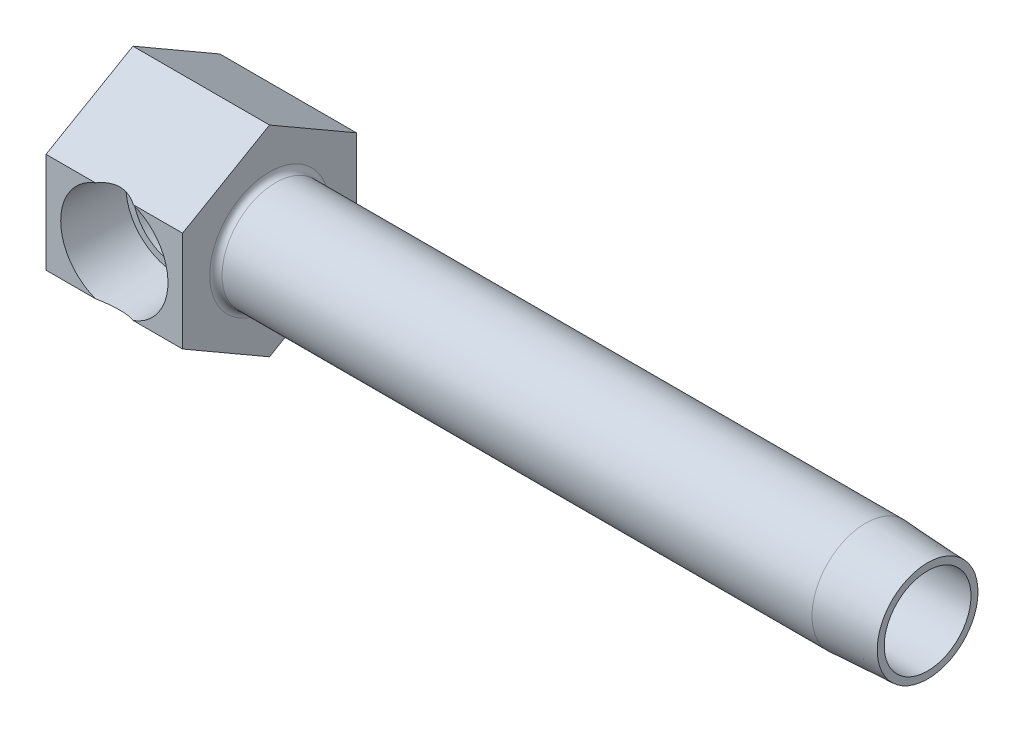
ISO-10303-21;
HEADER;
FILE_DESCRIPTION(('STEP AP214'),'2;1');
FILE_NAME('part.step','',(''),(''),'','','');
FILE_SCHEMA(('AUTOMOTIVE_DESIGN { 1 0 10303 214 1 1 1 1 }'));
ENDSEC;
DATA;
#1=APPLICATION_CONTEXT('core data for automotive mechanical design processes');
#2=APPLICATION_PROTOCOL_DEFINITION('international standard','automotive_design',2000,#1);
#3=PRODUCT_CONTEXT('',#1,'mechanical');
#4=PRODUCT('Part','Part','',(#3));
#5=PRODUCT_RELATED_PRODUCT_CATEGORY('part','',(#4));
#6=PRODUCT_DEFINITION_FORMATION('','',#4);
#7=PRODUCT_DEFINITION_CONTEXT('part definition',#1,'design');
#8=PRODUCT_DEFINITION('design','',#6,#7);
#9=PRODUCT_DEFINITION_SHAPE('','',#8);
#10=(LENGTH_UNIT() NAMED_UNIT(*) SI_UNIT(.MILLI.,.METRE.));
#11=(NAMED_UNIT(*) PLANE_ANGLE_UNIT() SI_UNIT($,.RADIAN.));
#12=(NAMED_UNIT(*) SI_UNIT($,.STERADIAN.) SOLID_ANGLE_UNIT());
#13=UNCERTAINTY_MEASURE_WITH_UNIT(LENGTH_MEASURE(1.E-05),#10,'distance_accuracy_value','');
#14=(GEOMETRIC_REPRESENTATION_CONTEXT(3) GLOBAL_UNCERTAINTY_ASSIGNED_CONTEXT((#13)) GLOBAL_UNIT_ASSIGNED_CONTEXT((#10,
#11,#12)) REPRESENTATION_CONTEXT('',''));
#15=CARTESIAN_POINT('',(0.,0.,0.));
#16=DIRECTION('',(0.,0.,1.));
#17=DIRECTION('',(1.,0.,0.));
#18=AXIS2_PLACEMENT_3D('',#15,#16,#17);
#19=CARTESIAN_POINT('',(63.5,0.,11.1125));
#20=DIRECTION('',(-1.,0.,0.));
#21=DIRECTION('',(0.,0.,1.));
#22=AXIS2_PLACEMENT_3D('',#19,#20,#21);
#23=CYLINDRICAL_SURFACE('',#22,6.858);
#24=CARTESIAN_POINT('',(18.2499,0.,11.1125));
#25=DIRECTION('',(-1.,0.,0.));
#26=DIRECTION('',(0.,-1.,0.));
#27=AXIS2_PLACEMENT_3D('',#24,#25,#26);
#28=CIRCLE('',#27,6.858);
#29=CARTESIAN_POINT('',(18.2499,-6.858,11.1125));
#30=VERTEX_POINT('',#29);
#31=EDGE_CURVE('E22',#30,#30,#28,.F.);
#32=ORIENTED_EDGE('',*,*,#31,.T.);
#33=EDGE_LOOP('',(#32));
#34=FACE_BOUND('',#33,.T.);
#35=CARTESIAN_POINT('',(93.6752,0.,11.1125));
#36=DIRECTION('',(1.,0.,0.));
#37=DIRECTION('',(0.,0.,-1.));
#38=AXIS2_PLACEMENT_3D('',#35,#36,#37);
#39=CIRCLE('',#38,6.858);
#40=CARTESIAN_POINT('',(93.6752,0.,4.2545));
#41=VERTEX_POINT('',#40);
#42=EDGE_CURVE('E156',#41,#41,#39,.T.);
#43=ORIENTED_EDGE('',*,*,#42,.F.);
#44=EDGE_LOOP('',(#43));
#45=FACE_BOUND('',#44,.T.);
#46=ADVANCED_FACE('F15',(#34,#45),#23,.T.);
#47=CARTESIAN_POINT('',(8.7376,0.,22.225));
#48=DIRECTION('',(0.,0.,1.));
#49=DIRECTION('',(1.,0.,0.));
#50=AXIS2_PLACEMENT_3D('',#47,#48,#49);
#51=CONICAL_SURFACE('',#50,6.858,0.0523598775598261);
#52=CARTESIAN_POINT('',(8.7376,-0.680996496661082,34.5170205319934));
#53=DIRECTION('',(0.,-0.866025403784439,-0.5));
#54=DIRECTION('',(0.,-0.5,0.866025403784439));
#55=AXIS2_PLACEMENT_3D('',#52,#53,#54);
#56=ELLIPSE('',#55,15.0043949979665,7.47122554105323);
#57=CARTESIAN_POINT('',(11.1603281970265,6.4158048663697,22.225));
#58=VERTEX_POINT('',#57);
#59=CARTESIAN_POINT('',(6.3148718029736,6.4158048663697,22.225));
#60=VERTEX_POINT('',#59);
#61=EDGE_CURVE('E232',#58,#60,#56,.F.);
#62=ORIENTED_EDGE('',*,*,#61,.T.);
#63=CARTESIAN_POINT('',(8.7376,0.,22.225));
#64=DIRECTION('',(0.,0.,-1.));
#65=DIRECTION('',(-1.,0.,0.));
#66=AXIS2_PLACEMENT_3D('',#63,#64,#65);
#67=CIRCLE('',#66,6.858);
#68=CARTESIAN_POINT('',(6.31487180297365,-6.41580486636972,22.225));
#69=VERTEX_POINT('',#68);
#70=EDGE_CURVE('E36',#69,#60,#67,.T.);
#71=ORIENTED_EDGE('',*,*,#70,.F.);
#72=CARTESIAN_POINT('',(8.7376,0.680996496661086,34.5170205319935));
#73=DIRECTION('',(0.,0.866025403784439,-0.5));
#74=DIRECTION('',(0.,0.5,0.866025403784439));
#75=AXIS2_PLACEMENT_3D('',#72,#73,#74);
#76=ELLIPSE('',#75,15.0043949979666,7.47122554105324);
#77=CARTESIAN_POINT('',(11.1603281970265,-6.4158048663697,22.225));
#78=VERTEX_POINT('',#77);
#79=EDGE_CURVE('E10',#69,#78,#76,.F.);
#80=ORIENTED_EDGE('',*,*,#79,.T.);
#81=EDGE_CURVE('E249',#58,#78,#67,.T.);
#82=ORIENTED_EDGE('',*,*,#81,.F.);
#83=EDGE_LOOP('',(#62,#71,#80,#82));
#84=FACE_BOUND('',#83,.T.);
#85=CARTESIAN_POINT('',(8.7376,0.,14.3002));
#86=DIRECTION('',(0.,0.,-1.));
#87=DIRECTION('',(-1.,0.,0.));
#88=AXIS2_PLACEMENT_3D('',#85,#86,#87);
#89=CIRCLE('',#88,6.44267883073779);
#90=CARTESIAN_POINT('',(13.3057672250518,-4.54312213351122,14.3002));
#91=VERTEX_POINT('',#90);
#92=CARTESIAN_POINT('',(13.3057672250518,4.54312213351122,14.3002));
#93=VERTEX_POINT('',#92);
#94=EDGE_CURVE('E251',#91,#93,#89,.T.);
#95=ORIENTED_EDGE('',*,*,#94,.T.);
#96=CARTESIAN_POINT('',(13.3056128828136,4.54326245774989,14.3));
#97=CARTESIAN_POINT('',(13.4050037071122,4.45290836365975,14.4287190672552));
#98=CARTESIAN_POINT('',(13.5038252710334,4.35690222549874,14.5539811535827));
#99=CARTESIAN_POINT('',(13.6989301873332,4.15324987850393,14.7972290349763));
#100=CARTESIAN_POINT('',(13.7952093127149,4.04558563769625,14.9152031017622));
#101=CARTESIAN_POINT('',(13.9843700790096,3.81752411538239,15.1441485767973));
#102=CARTESIAN_POINT('',(14.0772125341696,3.69701926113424,15.25504596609));
#103=CARTESIAN_POINT('',(14.2568464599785,3.44414434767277,15.4675620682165));
#104=CARTESIAN_POINT('',(14.3436418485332,3.31178210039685,15.5691868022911));
#105=CARTESIAN_POINT('',(14.5527686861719,2.962976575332,15.8122617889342));
#106=CARTESIAN_POINT('',(14.6701286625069,2.73858307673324,15.9469651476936));
#107=CARTESIAN_POINT('',(14.8276174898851,2.38307262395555,16.1264780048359));
#108=CARTESIAN_POINT('',(14.8769849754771,2.2615363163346,16.1825173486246));
#109=CARTESIAN_POINT('',(14.9687772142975,2.0125151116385,16.2864098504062));
#110=CARTESIAN_POINT('',(15.0112056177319,1.88503338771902,16.3342673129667));
#111=CARTESIAN_POINT('',(15.088733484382,1.6232487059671,16.4215218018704));
#112=CARTESIAN_POINT('',(15.1237419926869,1.48888366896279,16.4608139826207));
#113=CARTESIAN_POINT('',(15.1849785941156,1.21573970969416,16.5294343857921));
#114=CARTESIAN_POINT('',(15.2112114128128,1.0769632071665,16.5587679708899));
#115=CARTESIAN_POINT('',(15.2542466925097,0.796159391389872,16.6068431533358));
#116=CARTESIAN_POINT('',(15.2710505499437,0.654132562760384,16.6255863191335));
#117=CARTESIAN_POINT('',(15.2947665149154,0.368243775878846,16.6520290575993));
#118=CARTESIAN_POINT('',(15.3016803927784,0.22438215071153,16.6597306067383));
#119=CARTESIAN_POINT('',(15.3051381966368,-0.0413792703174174,16.6635827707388));
#120=CARTESIAN_POINT('',(15.3031178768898,-0.163241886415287,16.6613326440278));
#121=CARTESIAN_POINT('',(15.2919140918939,-0.406265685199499,16.6488476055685));
#122=CARTESIAN_POINT('',(15.282728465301,-0.527426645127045,16.6386102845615));
#123=CARTESIAN_POINT('',(15.2573805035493,-0.768029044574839,16.6103343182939));
#124=CARTESIAN_POINT('',(15.2412218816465,-0.88747136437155,16.5922998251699));
#125=CARTESIAN_POINT('',(15.2022471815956,-1.1238947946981,16.5487418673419));
#126=CARTESIAN_POINT('',(15.1794285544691,-1.24087494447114,16.5232155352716));
#127=CARTESIAN_POINT('',(15.1030013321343,-1.58064044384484,16.4375716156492));
#128=CARTESIAN_POINT('',(15.0406598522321,-1.79907617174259,16.3675454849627));
#129=CARTESIAN_POINT('',(14.8959772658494,-2.2198653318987,16.2041288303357));
#130=CARTESIAN_POINT('',(14.8136249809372,-2.42220969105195,16.1107252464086));
#131=CARTESIAN_POINT('',(14.6581620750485,-2.75475802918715,15.9330467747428));
#132=CARTESIAN_POINT('',(14.588877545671,-2.88934500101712,15.8534887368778));
#133=CARTESIAN_POINT('',(14.4433958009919,-3.14876465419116,15.6853070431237));
#134=CARTESIAN_POINT('',(14.3671982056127,-3.27359679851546,15.5966828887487));
#135=CARTESIAN_POINT('',(14.2091096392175,-3.51355050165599,15.4112660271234));
#136=CARTESIAN_POINT('',(14.1272094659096,-3.62865566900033,15.3144600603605));
#137=CARTESIAN_POINT('',(13.9591121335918,-3.84892561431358,15.1136697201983));
#138=CARTESIAN_POINT('',(13.8729164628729,-3.95409379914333,15.0096878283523));
#139=CARTESIAN_POINT('',(13.7069469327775,-4.14374167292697,14.806812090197));
#140=CARTESIAN_POINT('',(13.62749258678,-4.22922772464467,14.7085925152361));
#141=CARTESIAN_POINT('',(13.4673498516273,-4.39212627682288,14.5076746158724));
#142=CARTESIAN_POINT('',(13.386669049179,-4.46957495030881,14.404999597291));
#143=CARTESIAN_POINT('',(13.3056128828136,-4.54326245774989,14.3));
#144=B_SPLINE_CURVE_WITH_KNOTS('',3,(#96,#97,#98,#99,#100,#101,#102,#103,#104,#105,#106,#107,
#108,#109,#110,#111,#112,#113,#114,#115,#116,#117,#118,#119,#120,#121,#122,#123,#124,#125,#126,
#127,#128,#129,#130,#131,#132,#133,#134,#135,#136,#137,#138,#139,#140,#141,#142,#143),
.UNSPECIFIED.,.F.,.F.,(4,2,2,2,2,2,2,2,2,2,2,2,2,2,2,2,2,2,2,2,2,2,2,4),(0.,0.55807217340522,
1.11702021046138,1.68108674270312,2.24478434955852,3.10140634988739,3.52893103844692,
3.95623010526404,4.38849766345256,4.82053207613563,5.25250248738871,5.68439556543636,
6.04963287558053,6.41498039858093,6.78013360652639,7.14542675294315,7.85550743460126,
8.56598569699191,9.07835413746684,9.59075076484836,10.1039943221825,10.6170612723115,
11.0743952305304,11.5295724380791),.UNSPECIFIED.);
#145=EDGE_CURVE('E130',#93,#91,#144,.T.);
#146=ORIENTED_EDGE('',*,*,#145,.T.);
#147=EDGE_LOOP('',(#95,#146));
#148=FACE_BOUND('',#147,.T.);
#149=ADVANCED_FACE('F138',(#84,#148),#51,.F.);
#150=CARTESIAN_POINT('',(15.1802788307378,0.,14.3002));
#151=DIRECTION('',(0.,0.,1.));
#152=DIRECTION('',(1.,0.,0.));
#153=AXIS2_PLACEMENT_3D('',#150,#151,#152);
#154=PLANE('',#153);
#155=ORIENTED_EDGE('',*,*,#94,.F.);
#156=DIRECTION('',(1.,0.,0.));
#157=VECTOR('',#156,1.);
#158=CARTESIAN_POINT('',(65.6255637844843,-4.54312213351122,14.3002));
#159=LINE('',#158,#157);
#160=CARTESIAN_POINT('',(11.9253,-4.54312213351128,14.3002));
#161=VERTEX_POINT('',#160);
#162=EDGE_CURVE('E128',#91,#161,#159,.F.);
#163=ORIENTED_EDGE('',*,*,#162,.T.);
#164=CARTESIAN_POINT('',(8.7376,0.,14.3002));
#165=DIRECTION('',(0.,0.,-1.));
#166=DIRECTION('',(-1.,0.,0.));
#167=AXIS2_PLACEMENT_3D('',#164,#165,#166);
#168=CIRCLE('',#167,5.5499);
#169=CARTESIAN_POINT('',(11.9253,4.54312213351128,14.3002));
#170=VERTEX_POINT('',#169);
#171=EDGE_CURVE('E120',#161,#170,#168,.T.);
#172=ORIENTED_EDGE('',*,*,#171,.T.);
#173=DIRECTION('',(1.,0.,0.));
#174=VECTOR('',#173,1.);
#175=CARTESIAN_POINT('',(65.6255637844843,4.54312213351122,14.3002));
#176=LINE('',#175,#174);
#177=EDGE_CURVE('E123',#170,#93,#176,.T.);
#178=ORIENTED_EDGE('',*,*,#177,.T.);
#179=EDGE_LOOP('',(#155,#163,#172,#178));
#180=FACE_BOUND('',#179,.T.);
#181=ADVANCED_FACE('F181',(#180),#154,.T.);
#182=CARTESIAN_POINT('',(8.7376,0.,27.6280516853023));
#183=DIRECTION('',(0.,0.,-1.));
#184=DIRECTION('',(-1.,0.,0.));
#185=AXIS2_PLACEMENT_3D('',#182,#183,#184);
#186=CYLINDRICAL_SURFACE('',#185,5.5499);
#187=ORIENTED_EDGE('',*,*,#171,.F.);
#188=CARTESIAN_POINT('',(8.7376,0.,11.1125));
#189=DIRECTION('',(0.707106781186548,0.,-0.707106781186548));
#190=DIRECTION('',(-0.707106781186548,0.,-0.707106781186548));
#191=AXIS2_PLACEMENT_3D('',#188,#189,#190);
#192=ELLIPSE('',#191,7.84874384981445,5.5499);
#193=CARTESIAN_POINT('',(8.7376,-5.5499,11.1125));
#194=VERTEX_POINT('',#193);
#195=EDGE_CURVE('E109',#161,#194,#192,.T.);
#196=ORIENTED_EDGE('',*,*,#195,.T.);
#197=CARTESIAN_POINT('',(8.7376,0.,11.1125));
#198=DIRECTION('',(-0.707106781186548,0.,-0.707106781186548));
#199=DIRECTION('',(0.707106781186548,0.,-0.707106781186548));
#200=AXIS2_PLACEMENT_3D('',#197,#198,#199);
#201=ELLIPSE('',#200,7.84874384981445,5.5499);
#202=CARTESIAN_POINT('',(13.4708637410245,-2.89786203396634,6.37923625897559));
#203=VERTEX_POINT('',#202);
#204=EDGE_CURVE('E104',#194,#203,#201,.F.);
#205=ORIENTED_EDGE('',*,*,#204,.T.);
#206=CARTESIAN_POINT('',(8.7376,0.,6.37923625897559));
#207=DIRECTION('',(0.,0.,-1.));
#208=DIRECTION('',(-1.,0.,0.));
#209=AXIS2_PLACEMENT_3D('',#206,#207,#208);
#210=CIRCLE('',#209,5.5499);
#211=CARTESIAN_POINT('',(13.4708637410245,2.89786203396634,6.37923625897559));
#212=VERTEX_POINT('',#211);
#213=EDGE_CURVE('E136',#203,#212,#210,.T.);
#214=ORIENTED_EDGE('',*,*,#213,.T.);
#215=CARTESIAN_POINT('',(8.7376,5.5499,11.1125));
#216=VERTEX_POINT('',#215);
#217=EDGE_CURVE('E29',#212,#216,#201,.F.);
#218=ORIENTED_EDGE('',*,*,#217,.T.);
#219=EDGE_CURVE('E121',#216,#170,#192,.T.);
#220=ORIENTED_EDGE('',*,*,#219,.T.);
#221=EDGE_LOOP('',(#187,#196,#205,#214,#218,#220));
#222=FACE_BOUND('',#221,.T.);
#223=ADVANCED_FACE('F117',(#222),#186,.F.);
#224=CARTESIAN_POINT('',(8.7376,0.,6.37923625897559));
#225=DIRECTION('',(0.,0.,1.));
#226=DIRECTION('',(1.,0.,0.));
#227=AXIS2_PLACEMENT_3D('',#224,#225,#226);
#228=CONICAL_SURFACE('',#227,5.5499,1.04719755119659);
#229=CARTESIAN_POINT('',(8.7376,0.,3.175));
#230=VERTEX_POINT('',#229);
#231=VERTEX_LOOP('',#230);
#232=FACE_BOUND('',#231,.T.);
#233=ORIENTED_EDGE('',*,*,#213,.F.);
#234=CARTESIAN_POINT('',(13.4710699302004,-2.89818868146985,6.37943625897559));
#235=CARTESIAN_POINT('',(13.420685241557,-2.8185279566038,6.33063423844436));
#236=CARTESIAN_POINT('',(13.3737513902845,-2.73601453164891,6.2828976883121));
#237=CARTESIAN_POINT('',(13.2869939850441,-2.56583570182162,6.19038737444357));
#238=CARTESIAN_POINT('',(13.2471660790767,-2.47817349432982,6.14561180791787));
#239=CARTESIAN_POINT('',(13.1751547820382,-2.29911606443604,6.06025322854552));
#240=CARTESIAN_POINT('',(13.1428940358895,-2.20777091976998,6.01963042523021));
#241=CARTESIAN_POINT('',(13.0851463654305,-2.02119544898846,5.94274790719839));
#242=CARTESIAN_POINT('',(13.0596596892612,-1.92596498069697,5.90648835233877));
#243=CARTESIAN_POINT('',(13.0148514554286,-1.73255643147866,5.83897057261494));
#244=CARTESIAN_POINT('',(12.9955185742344,-1.63438413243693,5.80770321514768));
#245=CARTESIAN_POINT('',(12.9620830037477,-1.4356334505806,5.75050007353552));
#246=CARTESIAN_POINT('',(12.9479806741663,-1.33505490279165,5.72456465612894));
#247=CARTESIAN_POINT('',(12.9240526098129,-1.13183172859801,5.67823452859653));
#248=CARTESIAN_POINT('',(12.9142392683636,-1.0291819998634,5.65785593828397));
#249=CARTESIAN_POINT('',(12.8981074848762,-0.822623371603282,5.62290462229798));
#250=CARTESIAN_POINT('',(12.891789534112,-0.718714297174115,5.60833271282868));
#251=CARTESIAN_POINT('',(12.8810293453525,-0.489671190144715,5.58281999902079));
#252=CARTESIAN_POINT('',(12.8771967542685,-0.364365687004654,5.57314917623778));
#253=CARTESIAN_POINT('',(12.8729275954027,-0.113319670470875,5.56233429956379));
#254=CARTESIAN_POINT('',(12.8724915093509,0.0124209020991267,5.56119145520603));
#255=CARTESIAN_POINT('',(12.874939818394,0.263686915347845,5.567443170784));
#256=CARTESIAN_POINT('',(12.8778249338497,0.389212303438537,5.57483958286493));
#257=CARTESIAN_POINT('',(12.8874191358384,0.639322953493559,5.59811647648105));
#258=CARTESIAN_POINT('',(12.8941278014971,0.763908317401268,5.61399602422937));
#259=CARTESIAN_POINT('',(12.9116197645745,1.00072761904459,5.65236645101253));
#260=CARTESIAN_POINT('',(12.9220027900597,1.11310193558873,5.6741708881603));
#261=CARTESIAN_POINT('',(12.9479188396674,1.33574469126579,5.72453194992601));
#262=CARTESIAN_POINT('',(12.9634519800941,1.44601308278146,5.75308872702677));
#263=CARTESIAN_POINT('',(13.00082798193,1.66326683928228,5.81649299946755));
#264=CARTESIAN_POINT('',(13.022650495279,1.77026157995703,5.85132007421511));
#265=CARTESIAN_POINT('',(13.0737132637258,1.98033019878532,5.92673676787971));
#266=CARTESIAN_POINT('',(13.1029503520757,2.08340572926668,5.96732392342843));
#267=CARTESIAN_POINT('',(13.1785970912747,2.31167706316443,6.06504898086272));
#268=CARTESIAN_POINT('',(13.2275080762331,2.43541928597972,6.12371071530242));
#269=CARTESIAN_POINT('',(13.3111431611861,2.61414296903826,6.21635789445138));
#270=CARTESIAN_POINT('',(13.3408272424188,2.67271819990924,6.24810824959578));
#271=CARTESIAN_POINT('',(13.4034989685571,2.78735967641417,6.31288069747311));
#272=CARTESIAN_POINT('',(13.4364871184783,2.8434255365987,6.34590298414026));
#273=CARTESIAN_POINT('',(13.4710699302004,2.89818868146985,6.37943625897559));
#274=B_SPLINE_CURVE_WITH_KNOTS('',3,(#234,#235,#236,#237,#238,#239,#240,#241,#242,#243,#244,
#245,#246,#247,#248,#249,#250,#251,#252,#253,#254,#255,#256,#257,#258,#259,#260,#261,#262,#263,
#264,#265,#266,#267,#268,#269,#270,#271,#272,#273),.UNSPECIFIED.,.F.,.F.,(4,2,2,2,2,2,2,2,2,2,2,
2,2,2,2,2,2,2,2,4),(0.,0.318348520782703,0.636501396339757,0.951244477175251,1.26599908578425,
1.58017112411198,1.89436476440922,2.20946038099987,2.52460027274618,2.90145665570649,
3.27836648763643,3.65535808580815,4.03230819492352,4.37682355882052,4.72134670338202,
5.06476748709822,5.40804184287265,5.84309066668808,6.06180090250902,6.28054461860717),.UNSPECIFIED.);
#275=EDGE_CURVE('E111',#203,#212,#274,.T.);
#276=ORIENTED_EDGE('',*,*,#275,.T.);
#277=EDGE_LOOP('',(#233,#276));
#278=FACE_BOUND('',#277,.T.);
#279=ADVANCED_FACE('F148',(#232,#278),#228,.F.);
#280=CARTESIAN_POINT('',(17.4625,12.8316097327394,11.1125));
#281=DIRECTION('',(0.,-0.866025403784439,-0.5));
#282=DIRECTION('',(0.,0.5,-0.866025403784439));
#283=AXIS2_PLACEMENT_3D('',#280,#281,#282);
#284=PLANE('',#283);
#285=ORIENTED_EDGE('',*,*,#61,.F.);
#286=DIRECTION('',(-1.,0.,0.));
#287=VECTOR('',#286,1.);
#288=CARTESIAN_POINT('',(17.4625,6.4158048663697,22.225));
#289=LINE('',#288,#287);
#290=CARTESIAN_POINT('',(17.4625,6.4158048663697,22.225));
#291=VERTEX_POINT('',#290);
#292=EDGE_CURVE('E202',#291,#58,#289,.T.);
#293=ORIENTED_EDGE('',*,*,#292,.F.);
#294=DIRECTION('',(0.,-0.5,0.866025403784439));
#295=VECTOR('',#294,1.);
#296=CARTESIAN_POINT('',(17.4625,12.8316097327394,11.1125));
#297=LINE('',#296,#295);
#298=CARTESIAN_POINT('',(17.4625,12.8316097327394,11.1125));
#299=VERTEX_POINT('',#298);
#300=EDGE_CURVE('E222',#299,#291,#297,.T.);
#301=ORIENTED_EDGE('',*,*,#300,.F.);
#302=DIRECTION('',(-1.,0.,0.));
#303=VECTOR('',#302,1.);
#304=CARTESIAN_POINT('',(17.4625,12.8316097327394,11.1125));
#305=LINE('',#304,#303);
#306=CARTESIAN_POINT('',(0.,12.8316097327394,11.1125));
#307=VERTEX_POINT('',#306);
#308=EDGE_CURVE('E199',#299,#307,#305,.T.);
#309=ORIENTED_EDGE('',*,*,#308,.T.);
#310=DIRECTION('',(0.,-0.5,0.866025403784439));
#311=VECTOR('',#310,1.);
#312=CARTESIAN_POINT('',(0.,12.8316097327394,11.1125));
#313=LINE('',#312,#311);
#314=CARTESIAN_POINT('',(0.,6.4158048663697,22.225));
#315=VERTEX_POINT('',#314);
#316=EDGE_CURVE('E239',#307,#315,#313,.T.);
#317=ORIENTED_EDGE('',*,*,#316,.T.);
#318=EDGE_CURVE('E205',#60,#315,#289,.T.);
#319=ORIENTED_EDGE('',*,*,#318,.F.);
#320=EDGE_LOOP('',(#285,#293,#301,#309,#317,#319));
#321=FACE_BOUND('',#320,.T.);
#322=ADVANCED_FACE('F256',(#321),#284,.F.);
#323=CARTESIAN_POINT('',(17.4625,6.4158048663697,22.225));
#324=DIRECTION('',(0.,0.,-1.));
#325=DIRECTION('',(0.,1.,0.));
#326=AXIS2_PLACEMENT_3D('',#323,#324,#325);
#327=PLANE('',#326);
#328=ORIENTED_EDGE('',*,*,#70,.T.);
#329=ORIENTED_EDGE('',*,*,#318,.T.);
#330=DIRECTION('',(0.,-1.,0.));
#331=VECTOR('',#330,1.);
#332=CARTESIAN_POINT('',(0.,6.4158048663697,22.225));
#333=LINE('',#332,#331);
#334=CARTESIAN_POINT('',(0.,-6.41580486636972,22.225));
#335=VERTEX_POINT('',#334);
#336=EDGE_CURVE('E235',#315,#335,#333,.T.);
#337=ORIENTED_EDGE('',*,*,#336,.T.);
#338=DIRECTION('',(-1.,0.,0.));
#339=VECTOR('',#338,1.);
#340=CARTESIAN_POINT('',(17.4625,-6.41580486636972,22.225));
#341=LINE('',#340,#339);
#342=EDGE_CURVE('E209',#69,#335,#341,.T.);
#343=ORIENTED_EDGE('',*,*,#342,.F.);
#344=EDGE_LOOP('',(#328,#329,#337,#343));
#345=FACE_BOUND('',#344,.T.);
#346=ADVANCED_FACE('F263',(#345),#327,.F.);
#347=ORIENTED_EDGE('',*,*,#81,.T.);
#348=CARTESIAN_POINT('',(17.4625,-6.41580486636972,22.225));
#349=VERTEX_POINT('',#348);
#350=EDGE_CURVE('E206',#349,#78,#341,.T.);
#351=ORIENTED_EDGE('',*,*,#350,.F.);
#352=DIRECTION('',(0.,-1.,0.));
#353=VECTOR('',#352,1.);
#354=CARTESIAN_POINT('',(17.4625,6.4158048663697,22.225));
#355=LINE('',#354,#353);
#356=EDGE_CURVE('E220',#291,#349,#355,.T.);
#357=ORIENTED_EDGE('',*,*,#356,.F.);
#358=ORIENTED_EDGE('',*,*,#292,.T.);
#359=EDGE_LOOP('',(#347,#351,#357,#358));
#360=FACE_BOUND('',#359,.T.);
#361=ADVANCED_FACE('F287',(#360),#327,.F.);
#362=CARTESIAN_POINT('',(17.4625,-6.41580486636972,22.225));
#363=DIRECTION('',(0.,0.866025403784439,-0.5));
#364=DIRECTION('',(0.,0.5,0.866025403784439));
#365=AXIS2_PLACEMENT_3D('',#362,#363,#364);
#366=PLANE('',#365);
#367=ORIENTED_EDGE('',*,*,#79,.F.);
#368=ORIENTED_EDGE('',*,*,#342,.T.);
#369=DIRECTION('',(0.,-0.5,-0.866025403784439));
#370=VECTOR('',#369,1.);
#371=CARTESIAN_POINT('',(0.,-6.41580486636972,22.225));
#372=LINE('',#371,#370);
#373=CARTESIAN_POINT('',(0.,-12.8316097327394,11.1125));
#374=VERTEX_POINT('',#373);
#375=EDGE_CURVE('E218',#335,#374,#372,.T.);
#376=ORIENTED_EDGE('',*,*,#375,.T.);
#377=DIRECTION('',(-1.,0.,0.));
#378=VECTOR('',#377,1.);
#379=CARTESIAN_POINT('',(17.4625,-12.8316097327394,11.1125));
#380=LINE('',#379,#378);
#381=CARTESIAN_POINT('',(17.4625,-12.8316097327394,11.1125));
#382=VERTEX_POINT('',#381);
#383=EDGE_CURVE('E210',#382,#374,#380,.T.);
#384=ORIENTED_EDGE('',*,*,#383,.F.);
#385=DIRECTION('',(0.,-0.5,-0.866025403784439));
#386=VECTOR('',#385,1.);
#387=CARTESIAN_POINT('',(17.4625,-6.41580486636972,22.225));
#388=LINE('',#387,#386);
#389=EDGE_CURVE('E213',#349,#382,#388,.T.);
#390=ORIENTED_EDGE('',*,*,#389,.F.);
#391=ORIENTED_EDGE('',*,*,#350,.T.);
#392=EDGE_LOOP('',(#367,#368,#376,#384,#390,#391));
#393=FACE_BOUND('',#392,.T.);
#394=ADVANCED_FACE('F283',(#393),#366,.F.);
#395=CARTESIAN_POINT('',(17.4625,-12.8316097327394,11.1125));
#396=DIRECTION('',(0.,0.866025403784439,0.5));
#397=DIRECTION('',(0.,-0.5,0.866025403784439));
#398=AXIS2_PLACEMENT_3D('',#395,#396,#397);
#399=PLANE('',#398);
#400=DIRECTION('',(0.,0.5,-0.866025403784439));
#401=VECTOR('',#400,1.);
#402=CARTESIAN_POINT('',(0.,-12.8316097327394,11.1125));
#403=LINE('',#402,#401);
#404=CARTESIAN_POINT('',(0.,-6.41580486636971,0.));
#405=VERTEX_POINT('',#404);
#406=EDGE_CURVE('E227',#374,#405,#403,.T.);
#407=ORIENTED_EDGE('',*,*,#406,.T.);
#408=DIRECTION('',(-1.,0.,0.));
#409=VECTOR('',#408,1.);
#410=CARTESIAN_POINT('',(17.4625,-6.41580486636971,0.));
#411=LINE('',#410,#409);
#412=CARTESIAN_POINT('',(17.4625,-6.41580486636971,0.));
#413=VERTEX_POINT('',#412);
#414=EDGE_CURVE('E191',#413,#405,#411,.T.);
#415=ORIENTED_EDGE('',*,*,#414,.F.);
#416=DIRECTION('',(0.,0.5,-0.866025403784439));
#417=VECTOR('',#416,1.);
#418=CARTESIAN_POINT('',(17.4625,-12.8316097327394,11.1125));
#419=LINE('',#418,#417);
#420=EDGE_CURVE('E214',#382,#413,#419,.T.);
#421=ORIENTED_EDGE('',*,*,#420,.F.);
#422=ORIENTED_EDGE('',*,*,#383,.T.);
#423=EDGE_LOOP('',(#407,#415,#421,#422));
#424=FACE_BOUND('',#423,.T.);
#425=ADVANCED_FACE('F286',(#424),#399,.F.);
#426=CARTESIAN_POINT('',(17.4625,-6.41580486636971,0.));
#427=DIRECTION('',(0.,0.,1.));
#428=DIRECTION('',(1.,0.,0.));
#429=AXIS2_PLACEMENT_3D('',#426,#427,#428);
#430=PLANE('',#429);
#431=DIRECTION('',(0.,1.,0.));
#432=VECTOR('',#431,1.);
#433=CARTESIAN_POINT('',(0.,-6.41580486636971,0.));
#434=LINE('',#433,#432);
#435=CARTESIAN_POINT('',(0.,6.41580486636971,0.));
#436=VERTEX_POINT('',#435);
#437=EDGE_CURVE('E231',#405,#436,#434,.T.);
#438=ORIENTED_EDGE('',*,*,#437,.T.);
#439=DIRECTION('',(-1.,0.,0.));
#440=VECTOR('',#439,1.);
#441=CARTESIAN_POINT('',(17.4625,6.41580486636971,0.));
#442=LINE('',#441,#440);
#443=CARTESIAN_POINT('',(17.4625,6.41580486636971,0.));
#444=VERTEX_POINT('',#443);
#445=EDGE_CURVE('E196',#444,#436,#442,.T.);
#446=ORIENTED_EDGE('',*,*,#445,.F.);
#447=DIRECTION('',(0.,1.,0.));
#448=VECTOR('',#447,1.);
#449=CARTESIAN_POINT('',(17.4625,-6.41580486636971,0.));
#450=LINE('',#449,#448);
#451=EDGE_CURVE('E217',#413,#444,#450,.T.);
#452=ORIENTED_EDGE('',*,*,#451,.F.);
#453=ORIENTED_EDGE('',*,*,#414,.T.);
#454=EDGE_LOOP('',(#438,#446,#452,#453));
#455=FACE_BOUND('',#454,.T.);
#456=ADVANCED_FACE('F294',(#455),#430,.F.);
#457=CARTESIAN_POINT('',(17.4625,6.4158048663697,0.));
#458=DIRECTION('',(0.,-0.866025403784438,0.5));
#459=DIRECTION('',(0.,-0.5,-0.866025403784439));
#460=AXIS2_PLACEMENT_3D('',#457,#458,#459);
#461=PLANE('',#460);
#462=DIRECTION('',(0.,0.5,0.866025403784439));
#463=VECTOR('',#462,1.);
#464=CARTESIAN_POINT('',(0.,6.4158048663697,0.));
#465=LINE('',#464,#463);
#466=EDGE_CURVE('E243',#436,#307,#465,.T.);
#467=ORIENTED_EDGE('',*,*,#466,.T.);
#468=ORIENTED_EDGE('',*,*,#308,.F.);
#469=DIRECTION('',(0.,0.5,0.866025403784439));
#470=VECTOR('',#469,1.);
#471=CARTESIAN_POINT('',(17.4625,6.4158048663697,0.));
#472=LINE('',#471,#470);
#473=EDGE_CURVE('E224',#444,#299,#472,.T.);
#474=ORIENTED_EDGE('',*,*,#473,.F.);
#475=ORIENTED_EDGE('',*,*,#445,.T.);
#476=EDGE_LOOP('',(#467,#468,#474,#475));
#477=FACE_BOUND('',#476,.T.);
#478=ADVANCED_FACE('F281',(#477),#461,.F.);
#479=CARTESIAN_POINT('',(17.4625,-19.2474145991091,22.225));
#480=DIRECTION('',(-1.,0.,0.));
#481=DIRECTION('',(0.,-1.,0.));
#482=AXIS2_PLACEMENT_3D('',#479,#480,#481);
#483=PLANE('',#482);
#484=CARTESIAN_POINT('',(17.4625,0.,11.1125));
#485=DIRECTION('',(-1.,0.,0.));
#486=DIRECTION('',(0.,-1.,0.));
#487=AXIS2_PLACEMENT_3D('',#484,#485,#486);
#488=CIRCLE('',#487,7.6454);
#489=CARTESIAN_POINT('',(17.4625,-7.6454,11.1125));
#490=VERTEX_POINT('',#489);
#491=EDGE_CURVE('E189',#490,#490,#488,.T.);
#492=ORIENTED_EDGE('',*,*,#491,.T.);
#493=EDGE_LOOP('',(#492));
#494=FACE_BOUND('',#493,.T.);
#495=ORIENTED_EDGE('',*,*,#420,.T.);
#496=ORIENTED_EDGE('',*,*,#451,.T.);
#497=ORIENTED_EDGE('',*,*,#473,.T.);
#498=ORIENTED_EDGE('',*,*,#300,.T.);
#499=ORIENTED_EDGE('',*,*,#356,.T.);
#500=ORIENTED_EDGE('',*,*,#389,.T.);
#501=EDGE_LOOP('',(#495,#496,#497,#498,#499,#500));
#502=FACE_BOUND('',#501,.T.);
#503=ADVANCED_FACE('F277',(#494,#502),#483,.F.);
#504=CARTESIAN_POINT('',(0.,-19.2474145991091,22.225));
#505=DIRECTION('',(-1.,0.,0.));
#506=DIRECTION('',(0.,-1.,0.));
#507=AXIS2_PLACEMENT_3D('',#504,#505,#506);
#508=PLANE('',#507);
#509=ORIENTED_EDGE('',*,*,#406,.F.);
#510=ORIENTED_EDGE('',*,*,#375,.F.);
#511=ORIENTED_EDGE('',*,*,#336,.F.);
#512=ORIENTED_EDGE('',*,*,#316,.F.);
#513=ORIENTED_EDGE('',*,*,#466,.F.);
#514=ORIENTED_EDGE('',*,*,#437,.F.);
#515=EDGE_LOOP('',(#509,#510,#511,#512,#513,#514));
#516=FACE_BOUND('',#515,.T.);
#517=ADVANCED_FACE('F274',(#516),#508,.T.);
#518=CARTESIAN_POINT('',(18.2499,0.,11.1125));
#519=DIRECTION('',(-1.,0.,0.));
#520=DIRECTION('',(0.,-1.,0.));
#521=AXIS2_PLACEMENT_3D('',#518,#519,#520);
#522=TOROIDAL_SURFACE('',#521,7.6454,0.7874);
#523=ORIENTED_EDGE('',*,*,#31,.F.);
#524=EDGE_LOOP('',(#523));
#525=FACE_BOUND('',#524,.T.);
#526=ORIENTED_EDGE('',*,*,#491,.F.);
#527=EDGE_LOOP('',(#526));
#528=FACE_BOUND('',#527,.T.);
#529=ADVANCED_FACE('F146',(#525,#528),#522,.F.);
#530=CARTESIAN_POINT('',(65.6255637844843,0.,11.1125));
#531=DIRECTION('',(1.,0.,0.));
#532=DIRECTION('',(0.,0.,-1.));
#533=AXIS2_PLACEMENT_3D('',#530,#531,#532);
#534=CYLINDRICAL_SURFACE('',#533,5.5499);
#535=ORIENTED_EDGE('',*,*,#177,.F.);
#536=ORIENTED_EDGE('',*,*,#219,.F.);
#537=ORIENTED_EDGE('',*,*,#217,.F.);
#538=ORIENTED_EDGE('',*,*,#275,.F.);
#539=ORIENTED_EDGE('',*,*,#204,.F.);
#540=ORIENTED_EDGE('',*,*,#195,.F.);
#541=ORIENTED_EDGE('',*,*,#162,.F.);
#542=ORIENTED_EDGE('',*,*,#145,.F.);
#543=EDGE_LOOP('',(#535,#536,#537,#538,#539,#540,#541,#542));
#544=FACE_BOUND('',#543,.T.);
#545=CARTESIAN_POINT('',(101.6,0.,11.1125));
#546=DIRECTION('',(1.,0.,0.));
#547=DIRECTION('',(0.,0.,-1.));
#548=AXIS2_PLACEMENT_3D('',#545,#546,#547);
#549=CIRCLE('',#548,5.5499);
#550=CARTESIAN_POINT('',(101.6,0.,5.5626));
#551=VERTEX_POINT('',#550);
#552=EDGE_CURVE('E162',#551,#551,#549,.T.);
#553=ORIENTED_EDGE('',*,*,#552,.T.);
#554=EDGE_LOOP('',(#553));
#555=FACE_BOUND('',#554,.T.);
#556=ADVANCED_FACE('F106',(#544,#555),#534,.F.);
#557=CARTESIAN_POINT('',(101.6,0.,11.1125));
#558=DIRECTION('',(-1.,0.,0.));
#559=DIRECTION('',(0.,0.,1.));
#560=AXIS2_PLACEMENT_3D('',#557,#558,#559);
#561=CONICAL_SURFACE('',#560,6.44267883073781,0.052359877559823);
#562=ORIENTED_EDGE('',*,*,#42,.T.);
#563=EDGE_LOOP('',(#562));
#564=FACE_BOUND('',#563,.T.);
#565=CARTESIAN_POINT('',(101.6,0.,11.1125));
#566=DIRECTION('',(1.,0.,0.));
#567=DIRECTION('',(0.,0.,-1.));
#568=AXIS2_PLACEMENT_3D('',#565,#566,#567);
#569=CIRCLE('',#568,6.44267883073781);
#570=CARTESIAN_POINT('',(101.6,0.,4.66982116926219));
#571=VERTEX_POINT('',#570);
#572=EDGE_CURVE('E159',#571,#571,#569,.T.);
#573=ORIENTED_EDGE('',*,*,#572,.F.);
#574=EDGE_LOOP('',(#573));
#575=FACE_BOUND('',#574,.T.);
#576=ADVANCED_FACE('F145',(#564,#575),#561,.T.);
#577=CARTESIAN_POINT('',(101.6,0.,5.5626));
#578=DIRECTION('',(1.,0.,0.));
#579=DIRECTION('',(0.,0.,-1.));
#580=AXIS2_PLACEMENT_3D('',#577,#578,#579);
#581=PLANE('',#580);
#582=ORIENTED_EDGE('',*,*,#572,.T.);
#583=EDGE_LOOP('',(#582));
#584=FACE_BOUND('',#583,.T.);
#585=ORIENTED_EDGE('',*,*,#552,.F.);
#586=EDGE_LOOP('',(#585));
#587=FACE_BOUND('',#586,.T.);
#588=ADVANCED_FACE('F166',(#584,#587),#581,.T.);
#589=CLOSED_SHELL('',(#46,#149,#181,#223,#279,#322,#346,#361,#394,#425,#456,#478,#503,#517,#529,
#556,#576,#588));
#590=MANIFOLD_SOLID_BREP('B1',#589);
#591=ADVANCED_BREP_SHAPE_REPRESENTATION('',(#18,#590),#14);
#592=SHAPE_DEFINITION_REPRESENTATION(#9,#591);
ENDSEC;
END-ISO-10303-21;
